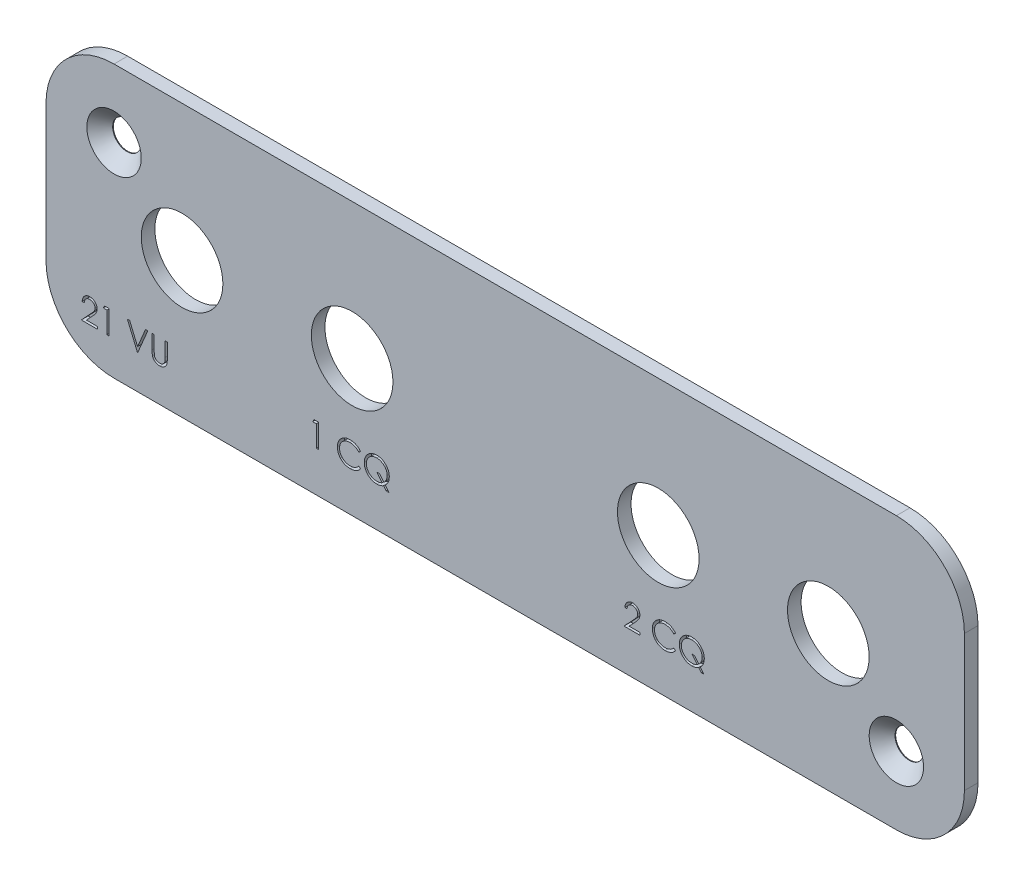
from build123d import *

# Parameters (mm, degrees)
ESQUISSE1_W             = 135
ESQUISSE1_H             = 40
BOSS_EXTRU_1_DEPTH      = 2
ESQUISSE2_R             = 2.1
ENL_V_MAT_EXTRU_1_DEPTH = 2
CHANFREIN1_SIZE         = 1.9
ESQUISSE3_R             = 6
ENL_V_MAT_EXTRU_3_DEPTH = 141.815482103
ENL_V_MAT_EXTRU_4_DEPTH = 1
CONG_1_R                = 10
ENL_V_MAT_EXTRU_5_DEPTH = 1
ESQUISSE6_R             = 6
ENL_V_MAT_EXTRU_6_DEPTH = 141.815482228


with BuildPart() as part:
    # Esquisse1 → Boss.-Extru.1 (new body)
    with BuildSketch(Plane.XY):
        with Locations((67.5, 20)):
            Rectangle(ESQUISSE1_W, ESQUISSE1_H)
    extrude(amount=BOSS_EXTRU_1_DEPTH)

    # Esquisse2 → Enl_v. mat.-Extru.1 (cut)
    with BuildSketch(Plane.XY.offset(2)):
        with Locations((10, 30)):
            Circle(ESQUISSE2_R)
        with Locations((125, 10)):
            Circle(ESQUISSE2_R)
    extrude(amount=-ENL_V_MAT_EXTRU_1_DEPTH, mode=Mode.SUBTRACT)

    # Chanfrein1
    chanfrein1_edges = [part.edges().sort_by_distance(p)[0] for p in [
        (7.9, 30, 2),
        (122.9, 10, 2),
    ]]
    chamfer(chanfrein1_edges, length=CHANFREIN1_SIZE)

    # Esquisse3 → Enl_v. mat.-Extru.3 (cut, through all)
    with BuildSketch(Plane.XY.offset(2)):
        with Locations((45, 20)):
            Circle(ESQUISSE3_R)
        with Locations((90, 20)):
            Circle(ESQUISSE3_R)
    extrude(amount=-ENL_V_MAT_EXTRU_3_DEPTH, mode=Mode.SUBTRACT)

    # Esquisse4 → Enl_v. mat.-Extru.4 (cut)
    with BuildSketch(Plane.XY.offset(2)):
        with BuildLine():
            Line((5.631155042, 7.431790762), (5.317052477, 7.431790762))
            add(Edge.make_bspline(
                [(5.317052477, 7.431790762), (5.319099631, 7.47346165), (5.323120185, 7.555302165), (5.341948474, 7.674626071), (5.368889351, 7.78868087), (5.406980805, 7.896550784), (5.454287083, 7.999189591), (5.51101711, 8.096189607), (5.578210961, 8.187180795), (5.654417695, 8.271319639), (5.737186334, 8.34850721), (5.826492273, 8.415162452), (5.920337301, 8.471480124), (6.018436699, 8.518561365), (6.121897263, 8.553901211), (6.229780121, 8.580122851), (6.342559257, 8.595899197), (6.419399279, 8.597594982), (6.45847876, 8.598457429)],
                knots=[0, 0, 0, 0, 1.10065271, 2.161652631, 3.183658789, 4.190468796, 5.17591951, 6.163126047, 7.15150782, 8.156236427, 9.156009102, 10.134482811, 11.092018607, 12.041330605, 13.001268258, 13.972401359, 14.968799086, 16, 16, 16, 16], degree=3))
            add(Edge.make_bspline(
                [(6.45847876, 8.598457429), (6.496856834, 8.597558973), (6.572268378, 8.595793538), (6.682330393, 8.580632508), (6.787107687, 8.556886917), (6.886395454, 8.523571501), (6.979401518, 8.478787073), (7.066824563, 8.424989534), (7.149705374, 8.362769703), (7.224312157, 8.28951589), (7.292820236, 8.211313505), (7.351922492, 8.127825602), (7.402535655, 8.041596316), (7.444723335, 7.951968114), (7.475779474, 7.858097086), (7.499357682, 7.761349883), (7.512685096, 7.660725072), (7.514730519, 7.592618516), (7.515770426, 7.557992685)],
                knots=[0, 0, 0, 0, 1.111607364, 2.184268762, 3.212621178, 4.221274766, 5.211760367, 6.196651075, 7.1921475, 8.207485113, 9.220403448, 10.201281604, 11.166441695, 12.114753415, 13.065576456, 14.026450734, 14.996634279, 16, 16, 16, 16], degree=3))
            add(Edge.make_bspline(
                [(7.515770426, 7.557992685), (7.514077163, 7.509244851), (7.510720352, 7.412604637), (7.482005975, 7.270589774), (7.437159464, 7.132996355), (7.383162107, 7.022259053), (7.328689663, 6.933025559), (7.279602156, 6.859556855), (7.222137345, 6.780451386), (7.155458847, 6.695974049), (7.080945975, 6.605463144), (6.997923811, 6.508973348), (6.905800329, 6.407501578), (6.841141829, 6.338195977), (6.807637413, 6.302283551)],
                knots=[0, 0, 0, 0, 1.184426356, 2.348067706, 3.509069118, 4.696110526, 5.333549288, 6.050745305, 6.844228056, 7.710549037, 8.667450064, 9.695053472, 10.805634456, 12, 12, 12, 12], degree=3))
            Line((6.807637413, 6.302283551), (5.931936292, 5.367688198))
            Line((5.931936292, 5.367688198), (7.560642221, 5.367688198))
            Line((7.560642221, 5.367688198), (7.560642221, 5.008713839))
            Line((7.560642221, 5.008713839), (5.182437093, 5.008713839))
            Line((5.182437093, 5.008713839), (6.539808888, 6.457231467))
            add(Edge.make_bspline(
                [(6.539808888, 6.457231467), (6.572856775, 6.491729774), (6.636335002, 6.557993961), (6.726117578, 6.654736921), (6.806756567, 6.744486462), (6.87877396, 6.82707301), (6.940607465, 6.903704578), (6.995479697, 6.971899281), (7.039445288, 7.034653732), (7.087160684, 7.107394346), (7.133374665, 7.196206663), (7.173087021, 7.304740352), (7.197301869, 7.416467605), (7.200206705, 7.491969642), (7.201667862, 7.529947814)],
                knots=[0, 0, 0, 0, 1.329631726, 2.553950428, 3.673215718, 4.687767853, 5.603093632, 6.413772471, 7.123043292, 7.734684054, 8.834405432, 9.900288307, 10.943827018, 12, 12, 12, 12], degree=3))
            add(Edge.make_bspline(
                [(7.201667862, 7.529947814), (7.20103212, 7.553829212), (7.199779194, 7.600894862), (7.188721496, 7.669900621), (7.17201099, 7.736465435), (7.148065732, 7.800794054), (7.116458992, 7.862239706), (7.077985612, 7.920877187), (7.033595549, 7.977566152), (6.982244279, 8.03071945), (6.92583276, 8.079400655), (6.86623851, 8.122524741), (6.803188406, 8.158563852), (6.736948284, 8.188107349), (6.667702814, 8.21128273), (6.595318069, 8.227341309), (6.519994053, 8.237423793), (6.468560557, 8.238787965), (6.442352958, 8.23948307)],
                knots=[0, 0, 0, 0, 0.991446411, 1.95395049, 2.89581595, 3.838931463, 4.798493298, 5.75982156, 6.748411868, 7.785213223, 8.824556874, 9.840280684, 10.836137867, 11.835679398, 12.848801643, 13.863922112, 14.911575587, 16, 16, 16, 16], degree=3))
            add(Edge.make_bspline(
                [(6.442352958, 8.23948307), (6.414982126, 8.238768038), (6.361230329, 8.237363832), (6.282311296, 8.227541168), (6.207025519, 8.210595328), (6.135183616, 8.187418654), (6.06666403, 8.157960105), (6.001799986, 8.12126836), (5.940737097, 8.077484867), (5.883360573, 8.027844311), (5.830496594, 7.972576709), (5.784049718, 7.910966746), (5.743465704, 7.844139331), (5.708056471, 7.77227478), (5.679300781, 7.694721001), (5.65732763, 7.611753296), (5.639940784, 7.523731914), (5.634132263, 7.462946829), (5.631155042, 7.431790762)],
                knots=[0, 0, 0, 0, 1.031018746, 2.02475058, 2.990194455, 3.934040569, 4.864654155, 5.795059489, 6.735614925, 7.690564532, 8.649604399, 9.611025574, 10.590972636, 11.591080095, 12.624614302, 13.701020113, 14.821632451, 16, 16, 16, 16], degree=3))
        make_face()
        Polygon((8.61863501, 8.508713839), (9.265770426, 8.508713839), (9.265770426, 5.008713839), (8.951667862, 5.008713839), (8.951667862, 8.14973948), (8.413206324, 8.14973948), align=None)
        Polygon((11.958078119, 8.508713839), (12.29461658, 8.508713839), (13.461283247, 5.750500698), (14.627949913, 8.508713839), (14.964488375, 8.508713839), (13.483719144, 5.008713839), (13.438847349, 5.008713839), align=None)
        with BuildLine():
            Line((15.592693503, 8.508713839), (15.906796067, 8.508713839))
            Line((15.906796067, 8.508713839), (15.906796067, 6.411658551))
            add(Edge.make_bspline(
                [(15.906796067, 6.411658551), (15.906749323, 6.381977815), (15.906660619, 6.325653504), (15.907253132, 6.245485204), (15.908912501, 6.174212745), (15.90995866, 6.111561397), (15.912285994, 6.057818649), (15.914184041, 6.012693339), (15.916624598, 5.976399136), (15.919557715, 5.95521821), (15.920818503, 5.946113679)],
                knots=[0, 0, 0, 0, 1.528628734, 2.90083645, 4.128790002, 5.200304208, 6.127813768, 6.898992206, 7.526736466, 8, 8, 8, 8], degree=3))
            add(Edge.make_bspline(
                [(15.920818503, 5.946113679), (15.925995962, 5.913266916), (15.936059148, 5.849424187), (15.961705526, 5.758515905), (15.997523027, 5.676584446), (16.03996607, 5.601073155), (16.095898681, 5.534083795), (16.162902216, 5.472372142), (16.244079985, 5.418400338), (16.334340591, 5.369049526), (16.431625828, 5.329384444), (16.531037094, 5.299391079), (16.631080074, 5.28111218), (16.698056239, 5.278995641), (16.731315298, 5.277944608)],
                knots=[0, 0, 0, 0, 1.035780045, 2.013197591, 2.933192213, 3.817615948, 4.702609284, 5.640816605, 6.646850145, 7.73207398, 8.84249596, 9.914020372, 10.964143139, 12, 12, 12, 12], degree=3))
            add(Edge.make_bspline(
                [(16.731315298, 5.277944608), (16.759869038, 5.279018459), (16.8168116, 5.281159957), (16.901418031, 5.294421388), (16.98381814, 5.318321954), (17.06441882, 5.349161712), (17.139969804, 5.389909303), (17.210513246, 5.436980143), (17.27347718, 5.492191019), (17.330935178, 5.553291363), (17.380970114, 5.622231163), (17.424341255, 5.697509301), (17.459867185, 5.780258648), (17.47741071, 5.83841307), (17.486423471, 5.86828916)],
                knots=[0, 0, 0, 0, 0.994687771, 1.983630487, 2.973142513, 3.978332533, 4.983357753, 5.956394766, 6.925816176, 7.893390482, 8.871859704, 9.88551698, 10.913711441, 12, 12, 12, 12], degree=3))
            add(Edge.make_bspline(
                [(17.486423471, 5.86828916), (17.489423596, 5.880637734), (17.496109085, 5.908155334), (17.50235613, 5.954676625), (17.508862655, 6.009565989), (17.513377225, 6.073217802), (17.517778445, 6.145418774), (17.520411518, 6.226545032), (17.521628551, 6.316301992), (17.521991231, 6.378939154), (17.522180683, 6.411658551)],
                knots=[0, 0, 0, 0, 0.558680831, 1.244966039, 2.062412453, 2.990489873, 4.051219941, 5.244515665, 6.560634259, 8, 8, 8, 8], degree=3))
            Line((17.522180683, 6.411658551), (17.522180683, 8.508713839))
            Line((17.522180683, 8.508713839), (17.836283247, 8.508713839))
            Line((17.836283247, 8.508713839), (17.836283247, 6.394831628))
            add(Edge.make_bspline(
                [(17.836283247, 6.394831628), (17.836029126, 6.356733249), (17.835533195, 6.282381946), (17.831232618, 6.173430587), (17.824375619, 6.070077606), (17.814687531, 5.972309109), (17.801850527, 5.88047495), (17.787575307, 5.793770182), (17.769395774, 5.712817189), (17.748162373, 5.636984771), (17.723888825, 5.564799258), (17.692447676, 5.496290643), (17.657023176, 5.429376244), (17.615008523, 5.365068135), (17.567797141, 5.303081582), (17.51434546, 5.243792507), (17.456421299, 5.18625346), (17.39306174, 5.131940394), (17.325311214, 5.082131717), (17.253371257, 5.038333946), (17.177794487, 5.001310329), (17.098777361, 4.970834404), (17.016286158, 4.947919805), (16.930318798, 4.930844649), (16.840679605, 4.921142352), (16.779714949, 4.919700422), (16.748843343, 4.91897025)],
                knots=[0, 0, 0, 0, 1.316592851, 2.569410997, 3.76748051, 4.895814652, 5.963796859, 6.97159953, 7.931736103, 8.829262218, 9.692595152, 10.560224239, 11.431080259, 12.30701507, 13.211635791, 14.121146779, 15.063487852, 16.031507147, 17.00238618, 17.966455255, 18.938106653, 19.907068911, 20.888905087, 21.893141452, 22.933117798, 24, 24, 24, 24], degree=3))
            add(Edge.make_bspline(
                [(16.748843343, 4.91897025), (16.71517424, 4.919755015), (16.649115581, 4.921294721), (16.551777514, 4.930117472), (16.458463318, 4.946735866), (16.368187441, 4.96789581), (16.282178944, 4.997079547), (16.199285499, 5.031177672), (16.120926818, 5.073054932), (16.04583169, 5.119648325), (15.976006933, 5.172072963), (15.91190953, 5.229213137), (15.85343366, 5.290153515), (15.801564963, 5.35555388), (15.755444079, 5.424905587), (15.715713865, 5.498404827), (15.681600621, 5.576023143), (15.663994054, 5.629976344), (15.655093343, 5.6572515)],
                knots=[0, 0, 0, 0, 1.13879206, 2.234305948, 3.301075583, 4.341971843, 5.366689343, 6.369221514, 7.369726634, 8.367512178, 9.355451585, 10.318319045, 11.268648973, 12.207971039, 13.137398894, 14.081662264, 15.030215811, 16, 16, 16, 16], degree=3))
            add(Edge.make_bspline(
                [(15.655093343, 5.6572515), (15.649916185, 5.675884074), (15.638686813, 5.716298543), (15.626661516, 5.783185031), (15.616552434, 5.860199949), (15.607046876, 5.947348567), (15.601437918, 6.044698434), (15.596520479, 6.15220735), (15.59265886, 6.270005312), (15.592681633, 6.352059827), (15.592693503, 6.394831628)],
                knots=[0, 0, 0, 0, 0.625038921, 1.35572334, 2.194682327, 3.136881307, 4.189498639, 5.346923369, 6.617055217, 8, 8, 8, 8], degree=3))
            Line((15.592693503, 6.394831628), (15.592693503, 8.508713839))
        make_face()
    extrude(amount=-ENL_V_MAT_EXTRU_4_DEPTH, mode=Mode.SUBTRACT)

    # Cong_1
    cong_1_edges = [part.edges().sort_by_distance(p)[0] for p in [
        (0, 40, 1),
        (135, 40, 1),
        (135, 0, 1),
        (0, 0, 1),
    ]]
    fillet(cong_1_edges, radius=CONG_1_R)

    # Esquisse5 → Enl_v. mat.-Extru.5 (cut)
    # profile 1 of 6: a face of its own
    with BuildSketch(Plane.XY.offset(2)):
        Polygon((39.405077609, 9.429172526), (40.052213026, 9.429172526), (40.052213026, 5.929172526), (39.738110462, 5.929172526), (39.738110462, 9.070198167), (39.199648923, 9.070198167), align=None)
    # profile 2 of 6: a face of its own
    with BuildSketch(Plane.XY.offset(2)):
        with BuildLine():
            Line((46.244520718, 8.786944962), (45.969680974, 8.576608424))
            add(Edge.make_bspline(
                [(45.969680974, 8.576608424), (45.950075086, 8.599974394), (45.911127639, 8.646391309), (45.848468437, 8.711570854), (45.783166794, 8.772636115), (45.715247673, 8.829877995), (45.643488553, 8.881294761), (45.569627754, 8.929565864), (45.492429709, 8.972833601), (45.385677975, 9.025296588), (45.246030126, 9.080042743), (45.070235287, 9.125945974), (44.886724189, 9.15516715), (44.761526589, 9.158331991), (44.697846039, 9.159941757)],
                knots=[0, 0, 0, 0, 0.757959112, 1.505699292, 2.245454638, 2.979532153, 3.711538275, 4.438200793, 5.171680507, 5.909471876, 7.393775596, 8.890124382, 10.418191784, 12, 12, 12, 12], degree=3))
            add(Edge.make_bspline(
                [(44.697846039, 9.159941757), (44.662762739, 9.159537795), (44.592921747, 9.158733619), (44.489273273, 9.148124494), (44.387560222, 9.133213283), (44.287848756, 9.11108796), (44.190265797, 9.083115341), (44.094173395, 9.049689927), (44.000962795, 9.008335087), (43.909344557, 8.962626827), (43.821565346, 8.910999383), (43.738510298, 8.854686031), (43.66048233, 8.794316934), (43.587419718, 8.729665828), (43.51924777, 8.661023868), (43.456460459, 8.587659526), (43.399275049, 8.509807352), (43.346558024, 8.428493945), (43.299345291, 8.343956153), (43.259815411, 8.255881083), (43.224810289, 8.16577698), (43.197111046, 8.072625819), (43.175186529, 7.977083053), (43.160058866, 7.878892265), (43.149570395, 7.778258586), (43.148770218, 7.710049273), (43.148366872, 7.675666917)],
                knots=[0, 0, 0, 0, 1.054917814, 2.100044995, 3.131103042, 4.146048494, 5.169673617, 6.183595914, 7.203665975, 8.234915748, 9.262203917, 10.264457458, 11.251630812, 12.227803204, 13.197192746, 14.159520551, 15.12972552, 16.100847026, 17.073214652, 18.039054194, 19.002613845, 19.979014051, 20.95965708, 21.949030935, 22.966165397, 24, 24, 24, 24], degree=3))
            add(Edge.make_bspline(
                [(43.148366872, 7.675666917), (43.149628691, 7.623935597), (43.152106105, 7.522368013), (43.174154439, 7.373597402), (43.207659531, 7.231076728), (43.257875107, 7.095696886), (43.319794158, 6.965788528), (43.39803477, 6.843549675), (43.488651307, 6.72713311), (43.592925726, 6.619290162), (43.707331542, 6.520776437), (43.830079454, 6.434025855), (43.960863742, 6.361710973), (44.098240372, 6.301535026), (44.243266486, 6.255278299), (44.395681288, 6.222714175), (44.555153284, 6.201471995), (44.664122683, 6.199438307), (44.719580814, 6.198403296)],
                knots=[0, 0, 0, 0, 1.029171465, 2.020641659, 2.987623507, 3.938342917, 4.889210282, 5.84687017, 6.821220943, 7.821438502, 8.827599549, 9.822697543, 10.807740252, 11.797342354, 12.80366471, 13.83203677, 14.896651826, 16, 16, 16, 16], degree=3))
            add(Edge.make_bspline(
                [(44.719580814, 6.198403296), (44.780683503, 6.200092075), (44.900948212, 6.203415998), (45.077316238, 6.231575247), (45.246152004, 6.277233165), (45.407464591, 6.341131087), (45.560799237, 6.424196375), (45.706395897, 6.524894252), (45.844377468, 6.644182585), (45.92734875, 6.735265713), (45.969680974, 6.781736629)],
                knots=[0, 0, 0, 0, 1.028121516, 2.023589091, 2.998037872, 3.967518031, 4.937445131, 5.927275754, 6.942489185, 8, 8, 8, 8], degree=3))
            Line((45.969680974, 6.781736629), (46.244520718, 6.573503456))
            add(Edge.make_bspline(
                [(46.244520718, 6.573503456), (46.222402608, 6.544965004), (46.178272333, 6.488024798), (46.106814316, 6.407753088), (46.031537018, 6.332249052), (45.951881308, 6.262121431), (45.868763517, 6.195966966), (45.780691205, 6.135665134), (45.688822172, 6.08037425), (45.593467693, 6.029747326), (45.49472908, 5.984830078), (45.392724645, 5.946376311), (45.28789407, 5.913251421), (45.180232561, 5.885999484), (45.069516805, 5.864728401), (44.956146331, 5.850508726), (44.839876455, 5.840766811), (44.761435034, 5.839878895), (44.72168418, 5.839428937)],
                knots=[0, 0, 0, 0, 0.986787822, 1.968848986, 2.935600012, 3.899624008, 4.868462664, 5.837806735, 6.815139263, 7.798259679, 8.787526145, 9.778297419, 10.776456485, 11.791383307, 12.812564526, 13.85620153, 14.913611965, 16, 16, 16, 16], degree=3))
            add(Edge.make_bspline(
                [(44.72168418, 5.839428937), (44.684040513, 5.839690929), (44.609604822, 5.840208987), (44.499706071, 5.848601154), (44.39271649, 5.860050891), (44.288941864, 5.877291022), (44.187815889, 5.897635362), (44.090255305, 5.924906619), (43.995300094, 5.955455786), (43.903331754, 5.991360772), (43.814272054, 6.031876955), (43.728408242, 6.077668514), (43.64577981, 6.128350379), (43.565574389, 6.182805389), (43.488976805, 6.242782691), (43.41532328, 6.307449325), (43.344200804, 6.376587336), (43.300198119, 6.426442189), (43.278074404, 6.451508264)],
                knots=[0, 0, 0, 0, 1.114604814, 2.203992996, 3.262667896, 4.300477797, 5.318619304, 6.316056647, 7.298880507, 8.271930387, 9.238335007, 10.195173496, 11.151986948, 12.108099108, 13.064862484, 14.031167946, 15.010108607, 16, 16, 16, 16], degree=3))
            add(Edge.make_bspline(
                [(43.278074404, 6.451508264), (43.24263876, 6.495049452), (43.172195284, 6.581606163), (43.0820696, 6.721892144), (43.004922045, 6.868360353), (42.942546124, 7.021780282), (42.893783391, 7.181807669), (42.860002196, 7.348523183), (42.838050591, 7.521771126), (42.835540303, 7.639607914), (42.834264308, 7.699505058)],
                knots=[0, 0, 0, 0, 0.994628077, 1.977248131, 2.950237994, 3.925870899, 4.908910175, 5.911660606, 6.938484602, 8, 8, 8, 8], degree=3))
            add(Edge.make_bspline(
                [(42.834264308, 7.699505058), (42.835819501, 7.762460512), (42.838879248, 7.886321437), (42.864875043, 8.06809539), (42.906693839, 8.242246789), (42.966090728, 8.408450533), (43.041396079, 8.567580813), (43.134422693, 8.718422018), (43.244089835, 8.861938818), (43.369537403, 8.995953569), (43.507104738, 9.118492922), (43.654423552, 9.226299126), (43.811205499, 9.316016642), (43.975723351, 9.391012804), (44.149209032, 9.448657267), (44.331292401, 9.489010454), (44.521631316, 9.51412757), (44.651493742, 9.517302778), (44.717477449, 9.518916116)],
                knots=[0, 0, 0, 0, 1.032925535, 2.032216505, 3.007276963, 3.968222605, 4.92396291, 5.891752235, 6.871517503, 7.883894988, 8.900124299, 9.891468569, 10.874487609, 11.85992873, 12.854644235, 13.869047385, 14.917252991, 16, 16, 16, 16], degree=3))
            add(Edge.make_bspline(
                [(44.717477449, 9.518916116), (44.757691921, 9.518433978), (44.837292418, 9.517479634), (44.95504507, 9.508173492), (45.069687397, 9.492659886), (45.181298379, 9.471543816), (45.290420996, 9.445336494), (45.396221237, 9.411196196), (45.499319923, 9.372159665), (45.599066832, 9.327201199), (45.694983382, 9.276734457), (45.7870397, 9.221318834), (45.874504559, 9.161023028), (45.957993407, 9.096359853), (46.036109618, 9.025961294), (46.111071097, 8.951763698), (46.180332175, 8.871629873), (46.22308537, 8.81522494), (46.244520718, 8.786944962)],
                knots=[0, 0, 0, 0, 1.096760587, 2.17092713, 3.219439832, 4.250915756, 5.268269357, 6.278326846, 7.281116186, 8.274029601, 9.260640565, 10.235837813, 11.203064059, 12.156899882, 13.114053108, 14.069676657, 15.032185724, 16, 16, 16, 16], degree=3))
        make_face()
    # profile 3 of 6: a face of its own
    with BuildSketch(Plane.XY.offset(2)):
        with BuildLine():
            Line((49.879837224, 6.318996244), (50.417597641, 5.659941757))
            Line((50.417597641, 5.659941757), (50.025670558, 5.659941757))
            Line((50.025670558, 5.659941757), (49.637249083, 6.135302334))
            add(Edge.make_bspline(
                [(49.637249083, 6.135302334), (49.598291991, 6.111628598), (49.521095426, 6.064717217), (49.400728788, 6.00425105), (49.277968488, 5.953935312), (49.153086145, 5.912365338), (49.026263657, 5.879091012), (48.896857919, 5.855997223), (48.765338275, 5.842586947), (48.676975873, 5.84048562), (48.632541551, 5.839428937)],
                knots=[0, 0, 0, 0, 1.030216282, 2.041455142, 3.041201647, 4.026904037, 5.014869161, 6.002481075, 6.995518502, 8, 8, 8, 8], degree=3))
            add(Edge.make_bspline(
                [(48.632541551, 5.839428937), (48.56888121, 5.840962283), (48.44361661, 5.843979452), (48.259646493, 5.870319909), (48.083062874, 5.911000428), (47.914217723, 5.969861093), (47.752927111, 6.045043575), (47.599265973, 6.137732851), (47.453156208, 6.246645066), (47.316754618, 6.371068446), (47.192029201, 6.506423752), (47.082590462, 6.65104479), (46.989537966, 6.80253175), (46.914299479, 6.961640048), (46.854587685, 7.126984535), (46.813895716, 7.29994033), (46.787556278, 7.479477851), (46.784521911, 7.601721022), (46.782982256, 7.663747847)],
                knots=[0, 0, 0, 0, 1.055750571, 2.07740284, 3.077223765, 4.05828044, 5.038417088, 6.02463293, 7.030503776, 8.057169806, 9.083586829, 10.080154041, 11.061747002, 12.027853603, 12.995569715, 13.972756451, 14.971366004, 16, 16, 16, 16], degree=3))
            add(Edge.make_bspline(
                [(46.782982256, 7.663747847), (46.783530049, 7.705379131), (46.784621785, 7.788349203), (46.797250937, 7.911236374), (46.816014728, 8.032100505), (46.842555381, 8.150439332), (46.87729931, 8.26673791), (46.918953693, 8.380766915), (46.969423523, 8.492232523), (47.026478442, 8.6009066), (47.090111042, 8.705847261), (47.159427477, 8.80556092), (47.234598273, 8.899064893), (47.315570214, 8.986316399), (47.402019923, 9.067508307), (47.493204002, 9.143977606), (47.591066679, 9.212879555), (47.693025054, 9.276955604), (47.799650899, 9.333301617), (47.908858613, 9.383673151), (48.021465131, 9.424543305), (48.136009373, 9.459369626), (48.253186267, 9.485957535), (48.37290449, 9.504583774), (48.49507982, 9.517334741), (48.57758746, 9.518385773), (48.619220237, 9.518916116)],
                knots=[0, 0, 0, 0, 1.030721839, 2.054201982, 3.056261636, 4.058906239, 5.055198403, 6.060579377, 7.06322398, 8.083343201, 9.098870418, 10.10084648, 11.0888991, 12.067804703, 13.046436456, 14.024708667, 15.012489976, 16.008294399, 17.005242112, 17.997338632, 18.984424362, 19.969624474, 20.960977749, 21.957320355, 22.969278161, 24, 24, 24, 24], degree=3))
            add(Edge.make_bspline(
                [(48.619220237, 9.518916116), (48.682880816, 9.517390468), (48.807914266, 9.514393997), (48.991428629, 9.488049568), (49.16749204, 9.447205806), (49.335979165, 9.38864511), (49.496739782, 9.313273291), (49.649706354, 9.220602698), (49.795116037, 9.111683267), (49.930804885, 8.987251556), (50.05523655, 8.851562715), (50.164156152, 8.706153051), (50.25682612, 8.553186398), (50.332200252, 8.392426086), (50.390752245, 8.223937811), (50.431681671, 8.047652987), (50.45790031, 7.863886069), (50.460929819, 7.738624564), (50.462469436, 7.674965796)],
                knots=[0, 0, 0, 0, 1.050672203, 2.063587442, 3.054842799, 4.031180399, 5.003107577, 5.981273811, 6.979214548, 7.998088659, 9.016962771, 10.014903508, 10.993069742, 11.96499692, 12.941334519, 13.932589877, 14.949327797, 16, 16, 16, 16], degree=3))
            add(Edge.make_bspline(
                [(50.462469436, 7.674965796), (50.460786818, 7.608728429), (50.457478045, 7.478476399), (50.429319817, 7.287475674), (50.38404633, 7.105024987), (50.319843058, 6.931243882), (50.236842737, 6.766163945), (50.13664887, 6.60813436), (50.018055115, 6.457166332), (49.92639506, 6.365537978), (49.879837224, 6.318996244)],
                knots=[0, 0, 0, 0, 1.045660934, 2.056233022, 3.041853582, 4.009978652, 4.97562384, 5.954545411, 6.961031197, 8, 8, 8, 8], degree=3))
        make_face()
        with BuildLine():
            add(Edge.make_bspline(
                [(49.668799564, 6.577710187), (49.706988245, 6.61649316), (49.782107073, 6.692780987), (49.879572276, 6.817888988), (49.963402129, 6.94793622), (50.030517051, 7.08465262), (50.083916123, 7.226325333), (50.120809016, 7.374076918), (50.143909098, 7.52723474), (50.146870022, 7.631414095), (50.148366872, 7.684080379)],
                knots=[0, 0, 0, 0, 1.052210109, 2.069743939, 3.061837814, 4.040478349, 5.010453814, 5.985306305, 6.981502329, 8, 8, 8, 8], degree=3))
            add(Edge.make_bspline(
                [(50.148366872, 7.684080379), (50.147975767, 7.717996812), (50.147202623, 7.785043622), (50.136571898, 7.884261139), (50.121532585, 7.981287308), (50.09976027, 8.075948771), (50.071722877, 8.168053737), (50.037094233, 8.257477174), (49.996549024, 8.34450757), (49.94928217, 8.428604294), (49.897174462, 8.509645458), (49.839172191, 8.586639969), (49.776091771, 8.659190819), (49.708622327, 8.728493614), (49.63546305, 8.793119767), (49.556876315, 8.853041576), (49.473830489, 8.909709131), (49.385914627, 8.960858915), (49.295317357, 9.00788316), (49.2025688, 9.048603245), (49.108447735, 9.083091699), (49.013099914, 9.111057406), (48.916648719, 9.133069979), (48.81892505, 9.148092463), (48.720181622, 9.158712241), (48.653837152, 9.159531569), (48.620622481, 9.159941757)],
                knots=[0, 0, 0, 0, 1.032958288, 2.041976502, 3.037103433, 4.023477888, 4.998866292, 5.968231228, 6.943073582, 7.921783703, 8.90545537, 9.876780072, 10.85618943, 11.833110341, 12.821898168, 13.827467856, 14.842673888, 15.88323808, 16.924703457, 17.951432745, 18.967462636, 19.976958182, 20.977218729, 21.979378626, 22.98839684, 24, 24, 24, 24], degree=3))
            add(Edge.make_bspline(
                [(48.620622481, 9.159941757), (48.587174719, 9.159528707), (48.520365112, 9.158703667), (48.421144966, 9.1481512), (48.323197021, 9.133053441), (48.226952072, 9.111150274), (48.13206928, 9.083130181), (48.038843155, 9.048433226), (47.946462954, 9.008718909), (47.856845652, 8.96172469), (47.770148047, 8.910135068), (47.687693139, 8.854030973), (47.610610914, 8.792852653), (47.538170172, 8.727585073), (47.470551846, 8.657724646), (47.407436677, 8.583736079), (47.349933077, 8.504760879), (47.297248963, 8.422212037), (47.250684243, 8.335999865), (47.208688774, 8.247679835), (47.174579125, 8.156278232), (47.146575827, 8.06252663), (47.123692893, 7.966658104), (47.108943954, 7.868116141), (47.098233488, 7.767515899), (47.097470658, 7.699534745), (47.097084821, 7.66515009)],
                knots=[0, 0, 0, 0, 1.013205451, 2.023808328, 3.020541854, 4.015386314, 5.012622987, 6.016502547, 7.02834558, 8.057881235, 9.080621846, 10.084476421, 11.077781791, 12.060654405, 13.037357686, 14.022218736, 15.005346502, 15.995617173, 16.98763393, 17.973029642, 18.956998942, 19.940662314, 20.93709383, 21.940823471, 22.958474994, 24, 24, 24, 24], degree=3))
            add(Edge.make_bspline(
                [(47.097084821, 7.66515009), (47.098398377, 7.614597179), (47.100982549, 7.515143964), (47.122404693, 7.369129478), (47.158321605, 7.229342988), (47.208570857, 7.095584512), (47.2716519, 6.96708309), (47.350097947, 6.845097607), (47.443574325, 6.730092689), (47.548544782, 6.621278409), (47.664013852, 6.52269703), (47.786422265, 6.435934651), (47.914724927, 6.362324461), (48.049324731, 6.302912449), (48.18921796, 6.255202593), (48.335508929, 6.222902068), (48.487241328, 6.201492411), (48.590632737, 6.199442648), (48.643058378, 6.198403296)],
                knots=[0, 0, 0, 0, 1.022526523, 2.011626, 2.97850031, 3.937665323, 4.897797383, 5.869804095, 6.865337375, 7.89202157, 8.925035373, 9.93268082, 10.923937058, 11.912550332, 12.905497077, 13.90928476, 14.939882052, 16, 16, 16, 16], degree=3))
            add(Edge.make_bspline(
                [(48.643058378, 6.198403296), (48.679076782, 6.198795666), (48.750318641, 6.199571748), (48.855372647, 6.210152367), (48.957855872, 6.225044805), (49.056819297, 6.247694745), (49.153121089, 6.275853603), (49.246188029, 6.310106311), (49.336513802, 6.350713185), (49.393946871, 6.382838), (49.422705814, 6.398924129)],
                knots=[0, 0, 0, 0, 1.060694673, 2.097979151, 3.107774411, 4.11000626, 5.086069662, 6.061987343, 7.029562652, 8, 8, 8, 8], degree=3))
            Line((49.422705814, 6.398924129), (48.634644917, 7.365069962))
            Line((48.634644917, 7.365069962), (49.026572, 7.365069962))
            Line((49.026572, 7.365069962), (49.668799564, 6.577710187))
        make_face(mode=Mode.SUBTRACT)
    # profile 4 of 6: a face of its own
    with BuildSketch(Plane.XY.offset(2)):
        with BuildLine():
            Line((85.411938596, 8.352249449), (85.097836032, 8.352249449))
            add(Edge.make_bspline(
                [(85.097836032, 8.352249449), (85.099883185, 8.393920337), (85.103903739, 8.475760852), (85.122732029, 8.595084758), (85.149672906, 8.709139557), (85.18776436, 8.817009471), (85.235070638, 8.919648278), (85.291800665, 9.016648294), (85.358994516, 9.107639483), (85.43520125, 9.191778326), (85.517969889, 9.268965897), (85.607275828, 9.335621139), (85.701120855, 9.391938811), (85.799220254, 9.439020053), (85.902680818, 9.474359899), (86.010563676, 9.500581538), (86.123342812, 9.516357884), (86.200182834, 9.518053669), (86.239262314, 9.518916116)],
                knots=[0, 0, 0, 0, 1.10065271, 2.161652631, 3.183658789, 4.190468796, 5.17591951, 6.163126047, 7.15150782, 8.156236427, 9.156009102, 10.134482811, 11.092018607, 12.041330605, 13.001268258, 13.972401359, 14.968799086, 16, 16, 16, 16], degree=3))
            add(Edge.make_bspline(
                [(86.239262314, 9.518916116), (86.277640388, 9.51801766), (86.353051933, 9.516252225), (86.463113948, 9.501091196), (86.567891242, 9.477345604), (86.667179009, 9.444030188), (86.760185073, 9.39924576), (86.847608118, 9.345448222), (86.930488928, 9.28322839), (87.005095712, 9.209974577), (87.073603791, 9.131772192), (87.132706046, 9.048284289), (87.18331921, 8.962055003), (87.22550689, 8.872426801), (87.256563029, 8.778555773), (87.280141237, 8.68180857), (87.29346865, 8.581183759), (87.295514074, 8.513077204), (87.296553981, 8.478451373)],
                knots=[0, 0, 0, 0, 1.111607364, 2.184268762, 3.212621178, 4.221274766, 5.211760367, 6.196651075, 7.1921475, 8.207485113, 9.220403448, 10.201281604, 11.166441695, 12.114753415, 13.065576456, 14.026450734, 14.996634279, 16, 16, 16, 16], degree=3))
            add(Edge.make_bspline(
                [(87.296553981, 8.478451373), (87.294860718, 8.429703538), (87.291503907, 8.333063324), (87.26278953, 8.191048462), (87.217943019, 8.053455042), (87.163945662, 7.94271774), (87.109473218, 7.853484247), (87.060385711, 7.780015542), (87.0029209, 7.700910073), (86.936242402, 7.616432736), (86.86172953, 7.525921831), (86.778707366, 7.429432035), (86.686583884, 7.327960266), (86.621925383, 7.258654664), (86.588420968, 7.222742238)],
                knots=[0, 0, 0, 0, 1.184426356, 2.348067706, 3.509069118, 4.696110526, 5.333549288, 6.050745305, 6.844228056, 7.710549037, 8.667450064, 9.695053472, 10.805634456, 12, 12, 12, 12], degree=3))
            Line((86.588420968, 7.222742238), (85.712719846, 6.288146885))
            Line((85.712719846, 6.288146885), (87.341425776, 6.288146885))
            Line((87.341425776, 6.288146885), (87.341425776, 5.929172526))
            Line((87.341425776, 5.929172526), (84.963220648, 5.929172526))
            Line((84.963220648, 5.929172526), (86.320592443, 7.377690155))
            add(Edge.make_bspline(
                [(86.320592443, 7.377690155), (86.353640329, 7.412188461), (86.417118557, 7.478452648), (86.506901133, 7.575195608), (86.587540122, 7.664945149), (86.659557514, 7.747531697), (86.72139102, 7.824163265), (86.776263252, 7.892357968), (86.820228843, 7.955112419), (86.867944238, 8.027853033), (86.91415822, 8.11666535), (86.953870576, 8.225199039), (86.978085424, 8.336926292), (86.98099026, 8.412428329), (86.982451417, 8.450406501)],
                knots=[0, 0, 0, 0, 1.329631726, 2.553950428, 3.673215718, 4.687767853, 5.603093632, 6.413772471, 7.123043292, 7.734684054, 8.834405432, 9.900288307, 10.943827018, 12, 12, 12, 12], degree=3))
            add(Edge.make_bspline(
                [(86.982451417, 8.450406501), (86.981815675, 8.474287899), (86.980562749, 8.521353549), (86.969505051, 8.590359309), (86.952794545, 8.656924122), (86.928849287, 8.721252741), (86.897242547, 8.782698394), (86.858769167, 8.841335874), (86.814379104, 8.898024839), (86.763027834, 8.951178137), (86.706616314, 8.999859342), (86.647022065, 9.042983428), (86.583971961, 9.079022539), (86.517731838, 9.108566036), (86.448486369, 9.131741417), (86.376101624, 9.147799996), (86.300777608, 9.15788248), (86.249344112, 9.159246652), (86.223136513, 9.159941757)],
                knots=[0, 0, 0, 0, 0.991446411, 1.95395049, 2.89581595, 3.838931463, 4.798493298, 5.75982156, 6.748411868, 7.785213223, 8.824556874, 9.840280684, 10.836137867, 11.835679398, 12.848801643, 13.863922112, 14.911575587, 16, 16, 16, 16], degree=3))
            add(Edge.make_bspline(
                [(86.223136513, 9.159941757), (86.19576568, 9.159226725), (86.142013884, 9.15782252), (86.063094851, 9.147999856), (85.987809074, 9.131054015), (85.915967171, 9.107877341), (85.847447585, 9.078418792), (85.782583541, 9.041727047), (85.721520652, 8.997943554), (85.664144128, 8.948302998), (85.611280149, 8.893035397), (85.564833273, 8.831425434), (85.524249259, 8.764598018), (85.488840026, 8.692733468), (85.460084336, 8.615179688), (85.438111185, 8.532211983), (85.420724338, 8.444190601), (85.414915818, 8.383405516), (85.411938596, 8.352249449)],
                knots=[0, 0, 0, 0, 1.031018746, 2.02475058, 2.990194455, 3.934040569, 4.864654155, 5.795059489, 6.735614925, 7.690564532, 8.649604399, 9.611025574, 10.590972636, 11.591080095, 12.624614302, 13.701020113, 14.821632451, 16, 16, 16, 16], degree=3))
        make_face()
    # profile 5 of 6: a face of its own
    with BuildSketch(Plane.XY.offset(2)):
        with BuildLine():
            Line((92.546553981, 8.786944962), (92.271714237, 8.576608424))
            add(Edge.make_bspline(
                [(92.271714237, 8.576608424), (92.252108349, 8.599974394), (92.213160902, 8.646391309), (92.1505017, 8.711570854), (92.085200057, 8.772636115), (92.017280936, 8.829877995), (91.945521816, 8.881294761), (91.871661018, 8.929565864), (91.794462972, 8.972833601), (91.687711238, 9.025296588), (91.548063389, 9.080042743), (91.37226855, 9.125945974), (91.188757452, 9.15516715), (91.063559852, 9.158331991), (90.999879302, 9.159941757)],
                knots=[0, 0, 0, 0, 0.757959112, 1.505699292, 2.245454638, 2.979532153, 3.711538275, 4.438200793, 5.171680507, 5.909471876, 7.393775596, 8.890124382, 10.418191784, 12, 12, 12, 12], degree=3))
            add(Edge.make_bspline(
                [(90.999879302, 9.159941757), (90.964796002, 9.159537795), (90.89495501, 9.158733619), (90.791306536, 9.148124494), (90.689593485, 9.133213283), (90.589882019, 9.11108796), (90.49229906, 9.083115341), (90.396206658, 9.049689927), (90.302996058, 9.008335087), (90.21137782, 8.962626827), (90.123598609, 8.910999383), (90.040543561, 8.854686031), (89.962515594, 8.794316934), (89.889452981, 8.729665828), (89.821281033, 8.661023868), (89.758493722, 8.587659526), (89.701308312, 8.509807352), (89.648591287, 8.428493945), (89.601378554, 8.343956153), (89.561848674, 8.255881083), (89.526843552, 8.16577698), (89.499144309, 8.072625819), (89.477219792, 7.977083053), (89.462092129, 7.878892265), (89.451603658, 7.778258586), (89.450803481, 7.710049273), (89.450400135, 7.675666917)],
                knots=[0, 0, 0, 0, 1.054917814, 2.100044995, 3.131103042, 4.146048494, 5.169673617, 6.183595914, 7.203665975, 8.234915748, 9.262203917, 10.264457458, 11.251630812, 12.227803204, 13.197192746, 14.159520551, 15.12972552, 16.100847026, 17.073214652, 18.039054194, 19.002613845, 19.979014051, 20.95965708, 21.949030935, 22.966165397, 24, 24, 24, 24], degree=3))
            add(Edge.make_bspline(
                [(89.450400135, 7.675666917), (89.451661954, 7.623935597), (89.454139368, 7.522368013), (89.476187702, 7.373597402), (89.509692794, 7.231076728), (89.559908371, 7.095696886), (89.621827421, 6.965788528), (89.700068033, 6.843549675), (89.79068457, 6.72713311), (89.894958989, 6.619290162), (90.009364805, 6.520776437), (90.132112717, 6.434025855), (90.262897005, 6.361710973), (90.400273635, 6.301535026), (90.545299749, 6.255278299), (90.697714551, 6.222714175), (90.857186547, 6.201471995), (90.966155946, 6.199438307), (91.021614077, 6.198403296)],
                knots=[0, 0, 0, 0, 1.029171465, 2.020641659, 2.987623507, 3.938342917, 4.889210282, 5.84687017, 6.821220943, 7.821438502, 8.827599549, 9.822697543, 10.807740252, 11.797342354, 12.80366471, 13.83203677, 14.896651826, 16, 16, 16, 16], degree=3))
            add(Edge.make_bspline(
                [(91.021614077, 6.198403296), (91.082716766, 6.200092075), (91.202981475, 6.203415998), (91.379349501, 6.231575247), (91.548185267, 6.277233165), (91.709497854, 6.341131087), (91.8628325, 6.424196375), (92.00842916, 6.524894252), (92.146410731, 6.644182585), (92.229382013, 6.735265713), (92.271714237, 6.781736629)],
                knots=[0, 0, 0, 0, 1.028121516, 2.023589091, 2.998037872, 3.967518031, 4.937445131, 5.927275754, 6.942489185, 8, 8, 8, 8], degree=3))
            Line((92.271714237, 6.781736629), (92.546553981, 6.573503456))
            add(Edge.make_bspline(
                [(92.546553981, 6.573503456), (92.524435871, 6.544965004), (92.480305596, 6.488024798), (92.408847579, 6.407753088), (92.333570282, 6.332249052), (92.253914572, 6.262121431), (92.17079678, 6.195966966), (92.082724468, 6.135665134), (91.990855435, 6.08037425), (91.895500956, 6.029747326), (91.796762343, 5.984830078), (91.694757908, 5.946376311), (91.589927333, 5.913251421), (91.482265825, 5.885999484), (91.371550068, 5.864728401), (91.258179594, 5.850508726), (91.141909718, 5.840766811), (91.063468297, 5.839878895), (91.023717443, 5.839428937)],
                knots=[0, 0, 0, 0, 0.986787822, 1.968848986, 2.935600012, 3.899624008, 4.868462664, 5.837806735, 6.815139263, 7.798259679, 8.787526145, 9.778297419, 10.776456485, 11.791383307, 12.812564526, 13.85620153, 14.913611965, 16, 16, 16, 16], degree=3))
            add(Edge.make_bspline(
                [(91.023717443, 5.839428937), (90.986073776, 5.839690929), (90.911638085, 5.840208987), (90.801739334, 5.848601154), (90.694749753, 5.860050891), (90.590975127, 5.877291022), (90.489849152, 5.897635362), (90.392288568, 5.924906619), (90.297333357, 5.955455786), (90.205365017, 5.991360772), (90.116305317, 6.031876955), (90.030441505, 6.077668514), (89.947813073, 6.128350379), (89.867607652, 6.182805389), (89.791010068, 6.242782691), (89.717356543, 6.307449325), (89.646234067, 6.376587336), (89.602231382, 6.426442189), (89.580107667, 6.451508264)],
                knots=[0, 0, 0, 0, 1.114604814, 2.203992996, 3.262667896, 4.300477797, 5.318619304, 6.316056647, 7.298880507, 8.271930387, 9.238335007, 10.195173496, 11.151986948, 12.108099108, 13.064862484, 14.031167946, 15.010108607, 16, 16, 16, 16], degree=3))
            add(Edge.make_bspline(
                [(89.580107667, 6.451508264), (89.544672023, 6.495049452), (89.474228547, 6.581606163), (89.384102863, 6.721892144), (89.306955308, 6.868360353), (89.244579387, 7.021780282), (89.195816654, 7.181807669), (89.162035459, 7.348523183), (89.140083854, 7.521771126), (89.137573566, 7.639607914), (89.136297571, 7.699505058)],
                knots=[0, 0, 0, 0, 0.994628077, 1.977248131, 2.950237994, 3.925870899, 4.908910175, 5.911660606, 6.938484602, 8, 8, 8, 8], degree=3))
            add(Edge.make_bspline(
                [(89.136297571, 7.699505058), (89.137852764, 7.762460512), (89.140912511, 7.886321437), (89.166908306, 8.06809539), (89.208727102, 8.242246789), (89.268123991, 8.408450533), (89.343429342, 8.567580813), (89.436455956, 8.718422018), (89.546123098, 8.861938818), (89.671570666, 8.995953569), (89.809138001, 9.118492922), (89.956456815, 9.226299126), (90.113238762, 9.316016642), (90.277756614, 9.391012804), (90.451242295, 9.448657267), (90.633325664, 9.489010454), (90.823664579, 9.51412757), (90.953527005, 9.517302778), (91.019510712, 9.518916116)],
                knots=[0, 0, 0, 0, 1.032925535, 2.032216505, 3.007276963, 3.968222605, 4.92396291, 5.891752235, 6.871517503, 7.883894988, 8.900124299, 9.891468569, 10.874487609, 11.85992873, 12.854644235, 13.869047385, 14.917252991, 16, 16, 16, 16], degree=3))
            add(Edge.make_bspline(
                [(91.019510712, 9.518916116), (91.059725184, 9.518433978), (91.139325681, 9.517479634), (91.257078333, 9.508173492), (91.37172066, 9.492659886), (91.483331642, 9.471543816), (91.592454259, 9.445336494), (91.6982545, 9.411196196), (91.801353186, 9.372159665), (91.901100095, 9.327201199), (91.997016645, 9.276734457), (92.089072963, 9.221318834), (92.176537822, 9.161023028), (92.26002667, 9.096359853), (92.338142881, 9.025961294), (92.41310436, 8.951763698), (92.482365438, 8.871629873), (92.525118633, 8.81522494), (92.546553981, 8.786944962)],
                knots=[0, 0, 0, 0, 1.096760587, 2.17092713, 3.219439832, 4.250915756, 5.268269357, 6.278326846, 7.281116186, 8.274029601, 9.260640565, 10.235837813, 11.203064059, 12.156899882, 13.114053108, 14.069676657, 15.032185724, 16, 16, 16, 16], degree=3))
        make_face()
    # profile 6 of 6: a face of its own
    with BuildSketch(Plane.XY.offset(2)):
        with BuildLine():
            Line((96.181870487, 6.318996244), (96.719630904, 5.659941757))
            Line((96.719630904, 5.659941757), (96.327703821, 5.659941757))
            Line((96.327703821, 5.659941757), (95.939282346, 6.135302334))
            add(Edge.make_bspline(
                [(95.939282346, 6.135302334), (95.900325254, 6.111628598), (95.823128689, 6.064717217), (95.702762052, 6.00425105), (95.580001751, 5.953935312), (95.455119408, 5.912365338), (95.32829692, 5.879091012), (95.198891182, 5.855997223), (95.067371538, 5.842586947), (94.979009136, 5.84048562), (94.934574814, 5.839428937)],
                knots=[0, 0, 0, 0, 1.030216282, 2.041455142, 3.041201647, 4.026904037, 5.014869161, 6.002481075, 6.995518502, 8, 8, 8, 8], degree=3))
            add(Edge.make_bspline(
                [(94.934574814, 5.839428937), (94.870914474, 5.840962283), (94.745649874, 5.843979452), (94.561679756, 5.870319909), (94.385096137, 5.911000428), (94.216250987, 5.969861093), (94.054960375, 6.045043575), (93.901299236, 6.137732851), (93.755189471, 6.246645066), (93.618787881, 6.371068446), (93.494062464, 6.506423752), (93.384623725, 6.65104479), (93.291571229, 6.80253175), (93.216332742, 6.961640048), (93.156620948, 7.126984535), (93.115928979, 7.29994033), (93.089589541, 7.479477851), (93.086555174, 7.601721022), (93.08501552, 7.663747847)],
                knots=[0, 0, 0, 0, 1.055750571, 2.07740284, 3.077223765, 4.05828044, 5.038417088, 6.02463293, 7.030503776, 8.057169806, 9.083586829, 10.080154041, 11.061747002, 12.027853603, 12.995569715, 13.972756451, 14.971366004, 16, 16, 16, 16], degree=3))
            add(Edge.make_bspline(
                [(93.08501552, 7.663747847), (93.085563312, 7.705379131), (93.086655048, 7.788349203), (93.0992842, 7.911236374), (93.118047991, 8.032100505), (93.144588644, 8.150439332), (93.179332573, 8.26673791), (93.220986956, 8.380766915), (93.271456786, 8.492232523), (93.328511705, 8.6009066), (93.392144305, 8.705847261), (93.46146074, 8.80556092), (93.536631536, 8.899064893), (93.617603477, 8.986316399), (93.704053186, 9.067508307), (93.795237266, 9.143977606), (93.893099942, 9.212879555), (93.995058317, 9.276955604), (94.101684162, 9.333301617), (94.210891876, 9.383673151), (94.323498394, 9.424543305), (94.438042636, 9.459369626), (94.55521953, 9.485957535), (94.674937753, 9.504583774), (94.797113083, 9.517334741), (94.879620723, 9.518385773), (94.9212535, 9.518916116)],
                knots=[0, 0, 0, 0, 1.030721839, 2.054201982, 3.056261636, 4.058906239, 5.055198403, 6.060579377, 7.06322398, 8.083343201, 9.098870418, 10.10084648, 11.0888991, 12.067804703, 13.046436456, 14.024708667, 15.012489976, 16.008294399, 17.005242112, 17.997338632, 18.984424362, 19.969624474, 20.960977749, 21.957320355, 22.969278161, 24, 24, 24, 24], degree=3))
            add(Edge.make_bspline(
                [(94.9212535, 9.518916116), (94.984914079, 9.517390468), (95.109947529, 9.514393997), (95.293461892, 9.488049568), (95.469525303, 9.447205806), (95.638012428, 9.38864511), (95.798773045, 9.313273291), (95.951739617, 9.220602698), (96.0971493, 9.111683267), (96.232838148, 8.987251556), (96.357269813, 8.851562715), (96.466189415, 8.706153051), (96.558859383, 8.553186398), (96.634233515, 8.392426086), (96.692785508, 8.223937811), (96.733714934, 8.047652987), (96.759933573, 7.863886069), (96.762963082, 7.738624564), (96.764502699, 7.674965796)],
                knots=[0, 0, 0, 0, 1.050672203, 2.063587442, 3.054842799, 4.031180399, 5.003107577, 5.981273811, 6.979214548, 7.998088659, 9.016962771, 10.014903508, 10.993069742, 11.96499692, 12.941334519, 13.932589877, 14.949327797, 16, 16, 16, 16], degree=3))
            add(Edge.make_bspline(
                [(96.764502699, 7.674965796), (96.762820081, 7.608728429), (96.759511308, 7.478476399), (96.73135308, 7.287475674), (96.686079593, 7.105024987), (96.621876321, 6.931243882), (96.538876, 6.766163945), (96.438682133, 6.60813436), (96.320088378, 6.457166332), (96.228428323, 6.365537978), (96.181870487, 6.318996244)],
                knots=[0, 0, 0, 0, 1.045660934, 2.056233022, 3.041853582, 4.009978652, 4.97562384, 5.954545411, 6.961031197, 8, 8, 8, 8], degree=3))
        make_face()
        with BuildLine():
            add(Edge.make_bspline(
                [(95.970832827, 6.577710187), (96.009021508, 6.61649316), (96.084140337, 6.692780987), (96.181605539, 6.817888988), (96.265435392, 6.94793622), (96.332550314, 7.08465262), (96.385949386, 7.226325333), (96.422842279, 7.374076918), (96.445942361, 7.52723474), (96.448903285, 7.631414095), (96.450400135, 7.684080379)],
                knots=[0, 0, 0, 0, 1.052210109, 2.069743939, 3.061837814, 4.040478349, 5.010453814, 5.985306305, 6.981502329, 8, 8, 8, 8], degree=3))
            add(Edge.make_bspline(
                [(96.450400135, 7.684080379), (96.45000903, 7.717996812), (96.449235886, 7.785043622), (96.438605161, 7.884261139), (96.423565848, 7.981287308), (96.401793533, 8.075948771), (96.37375614, 8.168053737), (96.339127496, 8.257477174), (96.298582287, 8.34450757), (96.251315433, 8.428604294), (96.199207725, 8.509645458), (96.141205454, 8.586639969), (96.078125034, 8.659190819), (96.01065559, 8.728493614), (95.937496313, 8.793119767), (95.858909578, 8.853041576), (95.775863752, 8.909709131), (95.68794789, 8.960858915), (95.59735062, 9.00788316), (95.504602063, 9.048603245), (95.410480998, 9.083091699), (95.315133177, 9.111057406), (95.218681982, 9.133069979), (95.120958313, 9.148092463), (95.022214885, 9.158712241), (94.955870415, 9.159531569), (94.922655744, 9.159941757)],
                knots=[0, 0, 0, 0, 1.032958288, 2.041976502, 3.037103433, 4.023477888, 4.998866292, 5.968231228, 6.943073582, 7.921783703, 8.90545537, 9.876780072, 10.85618943, 11.833110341, 12.821898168, 13.827467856, 14.842673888, 15.88323808, 16.924703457, 17.951432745, 18.967462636, 19.976958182, 20.977218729, 21.979378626, 22.98839684, 24, 24, 24, 24], degree=3))
            add(Edge.make_bspline(
                [(94.922655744, 9.159941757), (94.889207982, 9.159528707), (94.822398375, 9.158703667), (94.723178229, 9.1481512), (94.625230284, 9.133053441), (94.528985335, 9.111150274), (94.434102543, 9.083130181), (94.340876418, 9.048433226), (94.248496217, 9.008718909), (94.158878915, 8.96172469), (94.07218131, 8.910135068), (93.989726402, 8.854030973), (93.912644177, 8.792852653), (93.840203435, 8.727585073), (93.77258511, 8.657724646), (93.70946994, 8.583736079), (93.65196634, 8.504760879), (93.599282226, 8.422212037), (93.552717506, 8.335999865), (93.510722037, 8.247679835), (93.476612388, 8.156278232), (93.44860909, 8.06252663), (93.425726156, 7.966658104), (93.410977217, 7.868116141), (93.400266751, 7.767515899), (93.399503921, 7.699534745), (93.399118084, 7.66515009)],
                knots=[0, 0, 0, 0, 1.013205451, 2.023808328, 3.020541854, 4.015386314, 5.012622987, 6.016502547, 7.02834558, 8.057881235, 9.080621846, 10.084476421, 11.077781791, 12.060654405, 13.037357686, 14.022218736, 15.005346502, 15.995617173, 16.98763393, 17.973029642, 18.956998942, 19.940662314, 20.93709383, 21.940823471, 22.958474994, 24, 24, 24, 24], degree=3))
            add(Edge.make_bspline(
                [(93.399118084, 7.66515009), (93.40043164, 7.614597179), (93.403015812, 7.515143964), (93.424437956, 7.369129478), (93.460354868, 7.229342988), (93.51060412, 7.095584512), (93.573685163, 6.96708309), (93.65213121, 6.845097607), (93.745607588, 6.730092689), (93.850578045, 6.621278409), (93.966047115, 6.52269703), (94.088455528, 6.435934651), (94.21675819, 6.362324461), (94.351357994, 6.302912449), (94.491251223, 6.255202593), (94.637542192, 6.222902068), (94.789274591, 6.201492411), (94.892666, 6.199442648), (94.945091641, 6.198403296)],
                knots=[0, 0, 0, 0, 1.022526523, 2.011626, 2.97850031, 3.937665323, 4.897797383, 5.869804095, 6.865337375, 7.89202157, 8.925035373, 9.93268082, 10.923937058, 11.912550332, 12.905497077, 13.90928476, 14.939882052, 16, 16, 16, 16], degree=3))
            add(Edge.make_bspline(
                [(94.945091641, 6.198403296), (94.981110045, 6.198795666), (95.052351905, 6.199571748), (95.15740591, 6.210152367), (95.259889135, 6.225044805), (95.35885256, 6.247694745), (95.455154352, 6.275853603), (95.548221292, 6.310106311), (95.638547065, 6.350713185), (95.695980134, 6.382838), (95.724739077, 6.398924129)],
                knots=[0, 0, 0, 0, 1.060694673, 2.097979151, 3.107774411, 4.11000626, 5.086069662, 6.061987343, 7.029562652, 8, 8, 8, 8], degree=3))
            Line((95.724739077, 6.398924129), (94.93667818, 7.365069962))
            Line((94.93667818, 7.365069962), (95.328605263, 7.365069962))
            Line((95.328605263, 7.365069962), (95.970832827, 6.577710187))
        make_face(mode=Mode.SUBTRACT)
    extrude(amount=-ENL_V_MAT_EXTRU_5_DEPTH, mode=Mode.SUBTRACT)

    # Esquisse6 → Enl_v. mat.-Extru.6 (cut, through all)
    with BuildSketch(Plane.XY.offset(2)):
        with Locations((20, 20)):
            Circle(ESQUISSE6_R)
        with Locations((115, 20)):
            Circle(ESQUISSE6_R)
    extrude(amount=-ENL_V_MAT_EXTRU_6_DEPTH, mode=Mode.SUBTRACT)


solid = part.part
